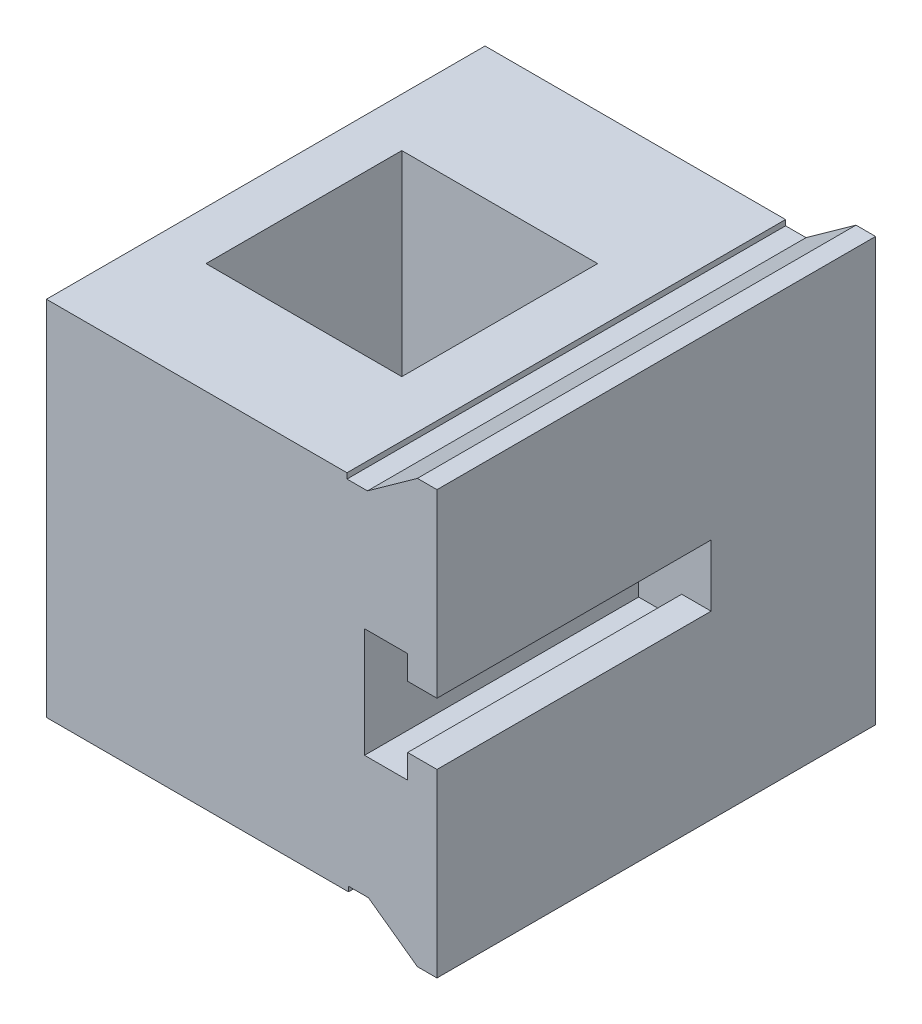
from build123d import *

# Parameters (mm, degrees)
SALIENTE_EXTRUIR1_DEPTH      = 21.8
SALIENTE_EXTRUIR1_DEPTH_BACK = 23
CORTAR_EXTRUIR1_DEPTH        = 56.65382942
CORTAR_EXTRUIR1_DEPTH_BACK   = 56.65382942
CROQUIS2_W                   = 20
CROQUIS2_H                   = 20
CROQUIS4_R                   = 3
CORTAR_EXTRUIR3_DEPTH        = 10
CROQUIS5_R                   = 6.5
CORTAR_EXTRUIR4_DEPTH        = 2
CORTAR_EXTRUIR5_DEPTH        = 28


with BuildPart() as part:
    # Croquis1 → Saliente-Extruir1 (new, two sides: drawn at the far end of the back side and taken through both)
    with BuildSketch(Plane.XY.offset(-SALIENTE_EXTRUIR1_DEPTH_BACK)):
        Polygon((-30.989332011, -16.758305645), (-5.135433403, -16.758305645), (-0.135433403, -16.758305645), (-0.137534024, -16.258306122), (-0.288534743, 19.683577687), (-0.290879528, 20.241694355), (-6.290879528, 20.241694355), (-30.989332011, 20.241694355), align=None)
        Polygon((-0.288534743, 19.683577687), (-0.137534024, -16.258306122), (1.902904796, -16.258306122), (6.902904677, -19.858306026), (8.902905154, -19.858306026), (8.902905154, 23.341694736), (6.902904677, 23.341694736), (1.801324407, 19.683577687), align=None)
    extrude(amount=SALIENTE_EXTRUIR1_DEPTH + SALIENTE_EXTRUIR1_DEPTH_BACK)

    # Croquis2 → Cortar-Extruir1 (cut, two sides: drawn at the far end of the back side and taken through both)
    with BuildSketch(Plane(origin=(0, 20.241694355, 0), x_dir=(1, 0, 0), z_dir=(0, 1, 0)).offset(-CORTAR_EXTRUIR1_DEPTH_BACK)):
        with Locations((-15.989332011, -0.5)):
            Rectangle(CROQUIS2_W, CROQUIS2_H)
    extrude(amount=CORTAR_EXTRUIR1_DEPTH + CORTAR_EXTRUIR1_DEPTH_BACK, mode=Mode.SUBTRACT)

    # Croquis4 → Cortar-Extruir3 (cut)
    with BuildSketch(Plane.ZY.offset(30.989332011)):
        with Locations((0, 2.243728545)):
            Circle(CROQUIS4_R)
    extrude(amount=-CORTAR_EXTRUIR3_DEPTH, mode=Mode.SUBTRACT)

    # Croquis5 → Cortar-Extruir4 (cut)
    with BuildSketch(Plane.ZY.offset(30.989332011)):
        with Locations((0, 2.243728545)):
            Circle(CROQUIS5_R)
    extrude(amount=-CORTAR_EXTRUIR4_DEPTH, mode=Mode.SUBTRACT)

    # Croquis6 → Cortar-Extruir5 (cut)
    with BuildSketch(Plane.XY.offset(21.8)):
        Polygon((8.902905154, -1.408305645), (5.902905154, -1.408305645), (5.902905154, -3.858305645), (1.502905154, -3.858305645), (1.502905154, 7.341694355), (5.902905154, 7.341694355), (5.902905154, 4.891694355), (8.902905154, 4.891694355), align=None)
    extrude(amount=-CORTAR_EXTRUIR5_DEPTH, mode=Mode.SUBTRACT)


solid = part.part
